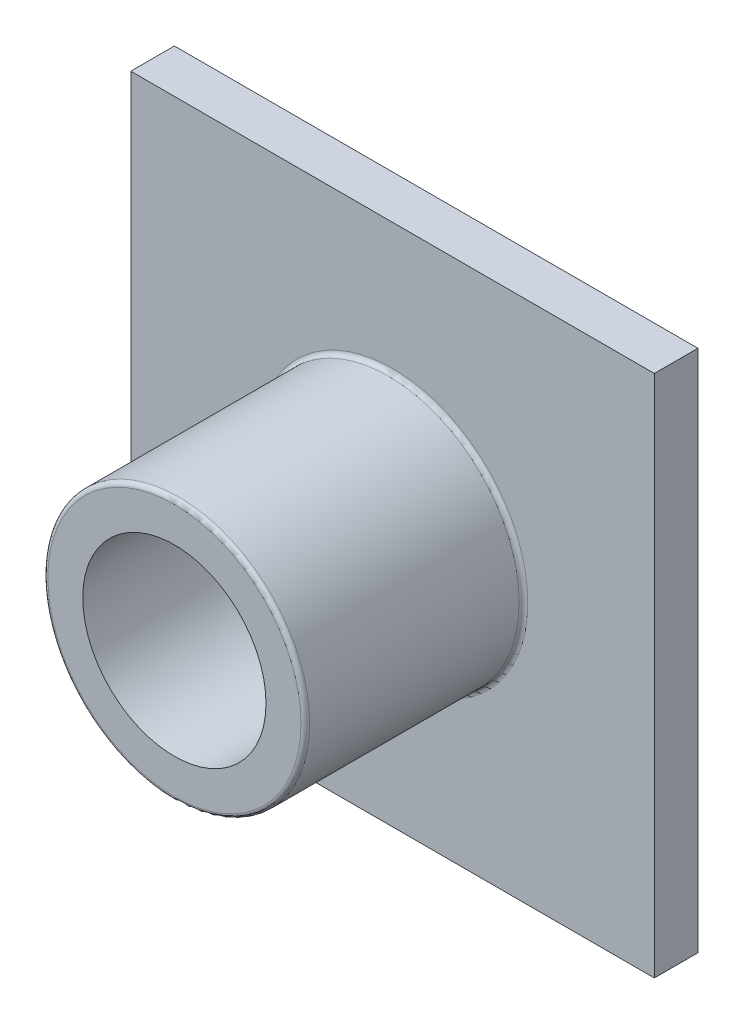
from build123d import *

# Parameters (mm, degrees)
ESQUISSE1_W      = 12
ESQUISSE1_H      = 12
EXTRUSION1_DEPTH = 1
ESQUISSE2_R      = 3
EXTRUSION2_DEPTH = 5
ESQUISSE3_R      = 2.1
EXTRUSION3_DEPTH = 11.392304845
CONG_1_R         = 0.6
CONG_2_R         = 0.1


with BuildPart() as part:
    # Esquisse1 → Extrusion1 (new body)
    with BuildSketch(Plane.XY):
        Rectangle(ESQUISSE1_W, ESQUISSE1_H)
    extrude(amount=EXTRUSION1_DEPTH)

    # Esquisse2 → Extrusion2 (add)
    with BuildSketch(Plane.XY.offset(1)):
        Circle(ESQUISSE2_R)
    extrude(amount=EXTRUSION2_DEPTH)

    # Esquisse3 → Extrusion3 (cut, through all)
    with BuildSketch(Plane.XY.offset(6)):
        Circle(ESQUISSE3_R)
    extrude(amount=-EXTRUSION3_DEPTH, mode=Mode.SUBTRACT)

    # Cong_1
    cong_1_edges = [part.edges().sort_by_distance(p)[0] for p in [
        (-2.1, 0, 0),
    ]]
    fillet(cong_1_edges, radius=CONG_1_R)

    # Cong_2
    cong_2_edges = [part.edges().sort_by_distance(p)[0] for p in [
        (-3, 0, 1),
        (-3, 0, 6),
    ]]
    fillet(cong_2_edges, radius=CONG_2_R)


solid = part.part
